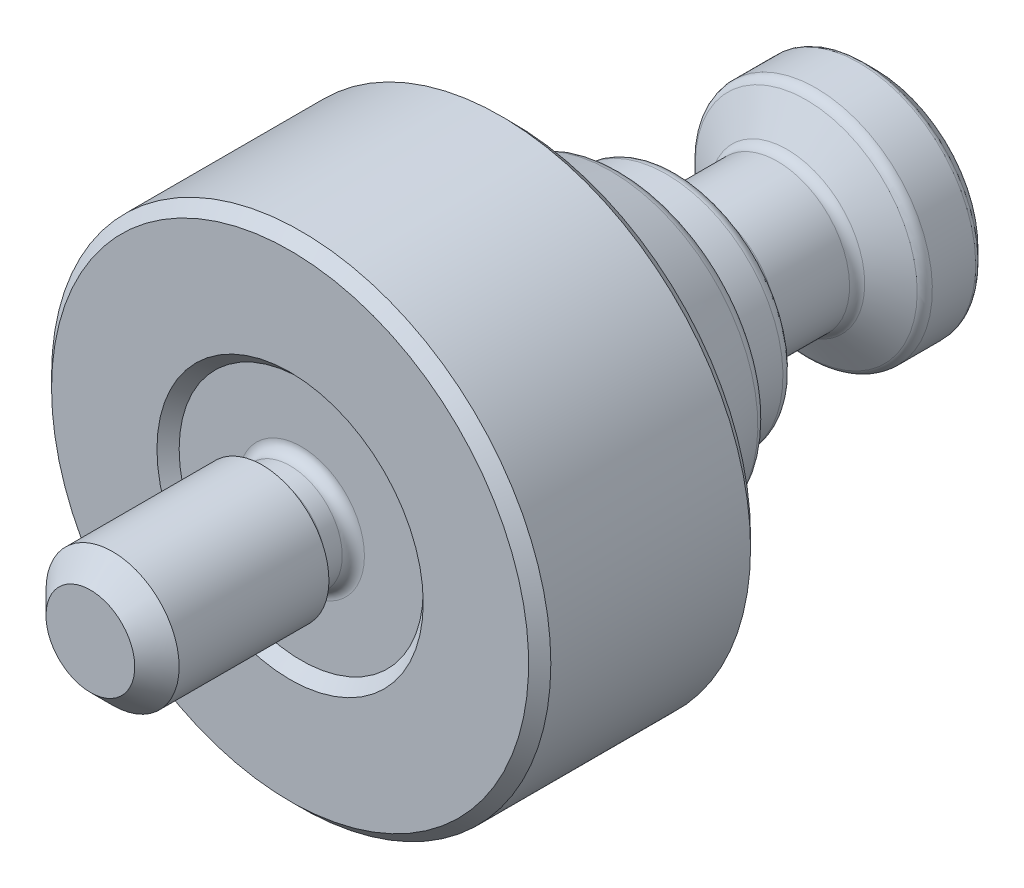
ISO-10303-21;
HEADER;
FILE_DESCRIPTION(('STEP AP214'),'2;1');
FILE_NAME('part.step','',(''),(''),'','','');
FILE_SCHEMA(('AUTOMOTIVE_DESIGN { 1 0 10303 214 1 1 1 1 }'));
ENDSEC;
DATA;
#1=APPLICATION_CONTEXT('core data for automotive mechanical design processes');
#2=APPLICATION_PROTOCOL_DEFINITION('international standard','automotive_design',2000,#1);
#3=PRODUCT_CONTEXT('',#1,'mechanical');
#4=PRODUCT('Part','Part','',(#3));
#5=PRODUCT_RELATED_PRODUCT_CATEGORY('part','',(#4));
#6=PRODUCT_DEFINITION_FORMATION('','',#4);
#7=PRODUCT_DEFINITION_CONTEXT('part definition',#1,'design');
#8=PRODUCT_DEFINITION('design','',#6,#7);
#9=PRODUCT_DEFINITION_SHAPE('','',#8);
#10=(LENGTH_UNIT() NAMED_UNIT(*) SI_UNIT(.MILLI.,.METRE.));
#11=(NAMED_UNIT(*) PLANE_ANGLE_UNIT() SI_UNIT($,.RADIAN.));
#12=(NAMED_UNIT(*) SI_UNIT($,.STERADIAN.) SOLID_ANGLE_UNIT());
#13=UNCERTAINTY_MEASURE_WITH_UNIT(LENGTH_MEASURE(1.E-05),#10,'distance_accuracy_value','');
#14=(GEOMETRIC_REPRESENTATION_CONTEXT(3) GLOBAL_UNCERTAINTY_ASSIGNED_CONTEXT((#13)) GLOBAL_UNIT_ASSIGNED_CONTEXT((#10,
#11,#12)) REPRESENTATION_CONTEXT('',''));
#15=CARTESIAN_POINT('',(0.,0.,0.));
#16=DIRECTION('',(0.,0.,1.));
#17=DIRECTION('',(1.,0.,0.));
#18=AXIS2_PLACEMENT_3D('',#15,#16,#17);
#19=CARTESIAN_POINT('',(0.,0.,19.));
#20=DIRECTION('',(0.,0.,-1.));
#21=DIRECTION('',(1.,0.,0.));
#22=AXIS2_PLACEMENT_3D('',#19,#20,#21);
#23=PLANE('',#22);
#24=CARTESIAN_POINT('',(0.,0.,19.));
#25=DIRECTION('',(0.,0.,1.));
#26=DIRECTION('',(1.,0.,0.));
#27=AXIS2_PLACEMENT_3D('',#24,#25,#26);
#28=CIRCLE('',#27,5.7);
#29=CARTESIAN_POINT('',(5.7,0.,19.));
#30=VERTEX_POINT('',#29);
#31=EDGE_CURVE('E23',#30,#30,#28,.T.);
#32=ORIENTED_EDGE('',*,*,#31,.F.);
#33=EDGE_LOOP('',(#32));
#34=FACE_BOUND('',#33,.T.);
#35=CARTESIAN_POINT('',(0.,0.,19.));
#36=DIRECTION('',(0.,0.,1.));
#37=DIRECTION('',(-1.,0.,0.));
#38=AXIS2_PLACEMENT_3D('',#35,#36,#37);
#39=CIRCLE('',#38,11.);
#40=CARTESIAN_POINT('',(-11.,0.,19.));
#41=VERTEX_POINT('',#40);
#42=EDGE_CURVE('E185',#41,#41,#39,.T.);
#43=ORIENTED_EDGE('',*,*,#42,.T.);
#44=EDGE_LOOP('',(#43));
#45=FACE_BOUND('',#44,.T.);
#46=ADVANCED_FACE('F14',(#34,#45),#23,.F.);
#47=CARTESIAN_POINT('',(0.,0.,38.));
#48=DIRECTION('',(0.,0.,1.));
#49=DIRECTION('',(0.,-1.,0.));
#50=AXIS2_PLACEMENT_3D('',#47,#48,#49);
#51=PLANE('',#50);
#52=CARTESIAN_POINT('',(0.,0.,38.));
#53=DIRECTION('',(0.,0.,1.));
#54=DIRECTION('',(0.,-1.,0.));
#55=AXIS2_PLACEMENT_3D('',#52,#53,#54);
#56=CIRCLE('',#55,4.);
#57=CARTESIAN_POINT('',(0.,-4.,38.));
#58=VERTEX_POINT('',#57);
#59=EDGE_CURVE('E125',#58,#58,#56,.T.);
#60=ORIENTED_EDGE('',*,*,#59,.T.);
#61=EDGE_LOOP('',(#60));
#62=FACE_BOUND('',#61,.T.);
#63=ADVANCED_FACE('F296',(#62),#51,.T.);
#64=CARTESIAN_POINT('',(0.,0.,36.));
#65=DIRECTION('',(0.,0.,-1.));
#66=DIRECTION('',(0.,1.,0.));
#67=AXIS2_PLACEMENT_3D('',#64,#65,#66);
#68=CONICAL_SURFACE('',#67,6.,0.78539816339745);
#69=ORIENTED_EDGE('',*,*,#59,.F.);
#70=EDGE_LOOP('',(#69));
#71=FACE_BOUND('',#70,.T.);
#72=CARTESIAN_POINT('',(0.,0.,36.));
#73=DIRECTION('',(0.,0.,1.));
#74=DIRECTION('',(0.,-1.,0.));
#75=AXIS2_PLACEMENT_3D('',#72,#73,#74);
#76=CIRCLE('',#75,6.);
#77=CARTESIAN_POINT('',(0.,-6.,36.));
#78=VERTEX_POINT('',#77);
#79=EDGE_CURVE('E122',#78,#78,#76,.F.);
#80=ORIENTED_EDGE('',*,*,#79,.F.);
#81=EDGE_LOOP('',(#80));
#82=FACE_BOUND('',#81,.T.);
#83=ADVANCED_FACE('F289',(#71,#82),#68,.T.);
#84=CARTESIAN_POINT('',(0.,0.,0.));
#85=DIRECTION('',(0.,0.,-1.));
#86=DIRECTION('',(0.,1.,0.));
#87=AXIS2_PLACEMENT_3D('',#84,#85,#86);
#88=CYLINDRICAL_SURFACE('',#87,6.);
#89=CARTESIAN_POINT('',(0.,0.,22.5));
#90=DIRECTION('',(0.,0.,-1.));
#91=DIRECTION('',(0.,1.,0.));
#92=AXIS2_PLACEMENT_3D('',#89,#90,#91);
#93=CIRCLE('',#92,6.);
#94=CARTESIAN_POINT('',(0.,6.,22.5));
#95=VERTEX_POINT('',#94);
#96=EDGE_CURVE('E193',#95,#95,#93,.T.);
#97=ORIENTED_EDGE('',*,*,#96,.F.);
#98=EDGE_LOOP('',(#97));
#99=FACE_BOUND('',#98,.T.);
#100=ORIENTED_EDGE('',*,*,#79,.T.);
#101=EDGE_LOOP('',(#100));
#102=FACE_BOUND('',#101,.T.);
#103=ADVANCED_FACE('F280',(#99,#102),#88,.T.);
#104=CARTESIAN_POINT('',(6.,0.,22.5));
#105=DIRECTION('',(0.,0.,1.));
#106=DIRECTION('',(0.,-1.,0.));
#107=AXIS2_PLACEMENT_3D('',#104,#105,#106);
#108=PLANE('',#107);
#109=CARTESIAN_POINT('',(0.,0.,22.5));
#110=DIRECTION('',(0.,0.,1.));
#111=DIRECTION('',(0.,-1.,0.));
#112=AXIS2_PLACEMENT_3D('',#109,#110,#111);
#113=CIRCLE('',#112,5.7);
#114=CARTESIAN_POINT('',(0.,-5.7,22.5));
#115=VERTEX_POINT('',#114);
#116=EDGE_CURVE('E18',#115,#115,#113,.T.);
#117=ORIENTED_EDGE('',*,*,#116,.T.);
#118=EDGE_LOOP('',(#117));
#119=FACE_BOUND('',#118,.T.);
#120=ORIENTED_EDGE('',*,*,#96,.T.);
#121=EDGE_LOOP('',(#120));
#122=FACE_BOUND('',#121,.T.);
#123=ADVANCED_FACE('F278',(#119,#122),#108,.F.);
#124=CARTESIAN_POINT('',(0.,0.,21.5));
#125=DIRECTION('',(0.,0.,1.));
#126=DIRECTION('',(0.,-1.,0.));
#127=AXIS2_PLACEMENT_3D('',#124,#125,#126);
#128=TOROIDAL_SURFACE('',#127,5.7,1.);
#129=ORIENTED_EDGE('',*,*,#116,.F.);
#130=EDGE_LOOP('',(#129));
#131=FACE_BOUND('',#130,.T.);
#132=CARTESIAN_POINT('',(0.,0.,21.5));
#133=DIRECTION('',(0.,0.,1.));
#134=DIRECTION('',(0.,-1.,0.));
#135=AXIS2_PLACEMENT_3D('',#132,#133,#134);
#136=CIRCLE('',#135,4.7);
#137=CARTESIAN_POINT('',(0.,-4.7,21.5));
#138=VERTEX_POINT('',#137);
#139=EDGE_CURVE('E161',#138,#138,#136,.F.);
#140=ORIENTED_EDGE('',*,*,#139,.F.);
#141=EDGE_LOOP('',(#140));
#142=FACE_BOUND('',#141,.T.);
#143=ADVANCED_FACE('F16',(#131,#142),#128,.F.);
#144=CARTESIAN_POINT('',(0.,0.,0.));
#145=DIRECTION('',(0.,0.,-1.));
#146=DIRECTION('',(0.,1.,0.));
#147=AXIS2_PLACEMENT_3D('',#144,#145,#146);
#148=CYLINDRICAL_SURFACE('',#147,4.7);
#149=CARTESIAN_POINT('',(0.,0.,20.));
#150=DIRECTION('',(0.,0.,1.));
#151=DIRECTION('',(0.,-1.,0.));
#152=AXIS2_PLACEMENT_3D('',#149,#150,#151);
#153=CIRCLE('',#152,4.7);
#154=CARTESIAN_POINT('',(0.,-4.7,20.));
#155=VERTEX_POINT('',#154);
#156=EDGE_CURVE('E163',#155,#155,#153,.T.);
#157=ORIENTED_EDGE('',*,*,#156,.T.);
#158=EDGE_LOOP('',(#157));
#159=FACE_BOUND('',#158,.T.);
#160=ORIENTED_EDGE('',*,*,#139,.T.);
#161=EDGE_LOOP('',(#160));
#162=FACE_BOUND('',#161,.T.);
#163=ADVANCED_FACE('F282',(#159,#162),#148,.T.);
#164=CARTESIAN_POINT('',(0.,0.,20.));
#165=DIRECTION('',(0.,0.,1.));
#166=DIRECTION('',(0.,-1.,0.));
#167=AXIS2_PLACEMENT_3D('',#164,#165,#166);
#168=TOROIDAL_SURFACE('',#167,5.7,1.);
#169=ORIENTED_EDGE('',*,*,#156,.F.);
#170=EDGE_LOOP('',(#169));
#171=FACE_BOUND('',#170,.T.);
#172=ORIENTED_EDGE('',*,*,#31,.T.);
#173=EDGE_LOOP('',(#172));
#174=FACE_BOUND('',#173,.T.);
#175=ADVANCED_FACE('F288',(#171,#174),#168,.F.);
#176=CARTESIAN_POINT('',(0.,0.,19.));
#177=DIRECTION('',(0.,0.,-1.));
#178=DIRECTION('',(1.,0.,0.));
#179=AXIS2_PLACEMENT_3D('',#176,#177,#178);
#180=CONICAL_SURFACE('',#179,22.5,0.78539816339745);
#181=CARTESIAN_POINT('',(0.,0.,20.));
#182=DIRECTION('',(0.,0.,1.));
#183=DIRECTION('',(-1.,0.,0.));
#184=AXIS2_PLACEMENT_3D('',#181,#182,#183);
#185=CIRCLE('',#184,21.5);
#186=CARTESIAN_POINT('',(-21.5,0.,20.));
#187=VERTEX_POINT('',#186);
#188=EDGE_CURVE('E177',#187,#187,#185,.T.);
#189=ORIENTED_EDGE('',*,*,#188,.F.);
#190=EDGE_LOOP('',(#189));
#191=FACE_BOUND('',#190,.T.);
#192=CARTESIAN_POINT('',(0.,0.,19.));
#193=DIRECTION('',(0.,0.,1.));
#194=DIRECTION('',(-1.,0.,0.));
#195=AXIS2_PLACEMENT_3D('',#192,#193,#194);
#196=CIRCLE('',#195,22.5);
#197=CARTESIAN_POINT('',(-22.5,0.,19.));
#198=VERTEX_POINT('',#197);
#199=EDGE_CURVE('E172',#198,#198,#196,.F.);
#200=ORIENTED_EDGE('',*,*,#199,.F.);
#201=EDGE_LOOP('',(#200));
#202=FACE_BOUND('',#201,.T.);
#203=ADVANCED_FACE('F300',(#191,#202),#180,.T.);
#204=CARTESIAN_POINT('',(11.0000000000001,0.,20.));
#205=DIRECTION('',(0.,0.,1.));
#206=DIRECTION('',(-1.,0.,0.));
#207=AXIS2_PLACEMENT_3D('',#204,#205,#206);
#208=PLANE('',#207);
#209=CARTESIAN_POINT('',(0.,0.,20.));
#210=DIRECTION('',(0.,0.,1.));
#211=DIRECTION('',(-1.,0.,0.));
#212=AXIS2_PLACEMENT_3D('',#209,#210,#211);
#213=CIRCLE('',#212,12.);
#214=CARTESIAN_POINT('',(-12.,0.,20.));
#215=VERTEX_POINT('',#214);
#216=EDGE_CURVE('E188',#215,#215,#213,.F.);
#217=ORIENTED_EDGE('',*,*,#216,.T.);
#218=EDGE_LOOP('',(#217));
#219=FACE_BOUND('',#218,.T.);
#220=ORIENTED_EDGE('',*,*,#188,.T.);
#221=EDGE_LOOP('',(#220));
#222=FACE_BOUND('',#221,.T.);
#223=ADVANCED_FACE('F381',(#219,#222),#208,.T.);
#224=CARTESIAN_POINT('',(0.,0.,20.));
#225=DIRECTION('',(0.,0.,1.));
#226=DIRECTION('',(-1.,0.,0.));
#227=AXIS2_PLACEMENT_3D('',#224,#225,#226);
#228=CONICAL_SURFACE('',#227,12.,0.785398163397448);
#229=ORIENTED_EDGE('',*,*,#42,.F.);
#230=EDGE_LOOP('',(#229));
#231=FACE_BOUND('',#230,.T.);
#232=ORIENTED_EDGE('',*,*,#216,.F.);
#233=EDGE_LOOP('',(#232));
#234=FACE_BOUND('',#233,.T.);
#235=ADVANCED_FACE('F385',(#231,#234),#228,.F.);
#236=CARTESIAN_POINT('',(0.,0.,0.));
#237=DIRECTION('',(0.,0.,-1.));
#238=DIRECTION('',(1.,0.,0.));
#239=AXIS2_PLACEMENT_3D('',#236,#237,#238);
#240=CYLINDRICAL_SURFACE('',#239,22.5);
#241=ORIENTED_EDGE('',*,*,#199,.T.);
#242=EDGE_LOOP('',(#241));
#243=FACE_BOUND('',#242,.T.);
#244=CARTESIAN_POINT('',(0.,0.,0.999999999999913));
#245=DIRECTION('',(0.,0.,-1.));
#246=DIRECTION('',(1.,0.,0.));
#247=AXIS2_PLACEMENT_3D('',#244,#245,#246);
#248=CIRCLE('',#247,22.5);
#249=CARTESIAN_POINT('',(22.5,0.,0.999999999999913));
#250=VERTEX_POINT('',#249);
#251=EDGE_CURVE('E168',#250,#250,#248,.F.);
#252=ORIENTED_EDGE('',*,*,#251,.T.);
#253=EDGE_LOOP('',(#252));
#254=FACE_BOUND('',#253,.T.);
#255=ADVANCED_FACE('F375',(#243,#254),#240,.T.);
#256=CARTESIAN_POINT('',(0.,0.,-1.19379064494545E-13));
#257=DIRECTION('',(0.,0.,1.));
#258=DIRECTION('',(-1.,0.,0.));
#259=AXIS2_PLACEMENT_3D('',#256,#257,#258);
#260=CONICAL_SURFACE('',#259,21.5,0.785398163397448);
#261=ORIENTED_EDGE('',*,*,#251,.F.);
#262=EDGE_LOOP('',(#261));
#263=FACE_BOUND('',#262,.T.);
#264=CARTESIAN_POINT('',(0.,0.,-1.19379064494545E-13));
#265=DIRECTION('',(0.,0.,-1.));
#266=DIRECTION('',(1.,0.,0.));
#267=AXIS2_PLACEMENT_3D('',#264,#265,#266);
#268=CIRCLE('',#267,21.5);
#269=CARTESIAN_POINT('',(21.5,0.,-1.19379064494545E-13));
#270=VERTEX_POINT('',#269);
#271=EDGE_CURVE('E182',#270,#270,#268,.T.);
#272=ORIENTED_EDGE('',*,*,#271,.F.);
#273=EDGE_LOOP('',(#272));
#274=FACE_BOUND('',#273,.T.);
#275=ADVANCED_FACE('F368',(#263,#274),#260,.T.);
#276=CARTESIAN_POINT('',(22.5,0.,-1.19379064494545E-13));
#277=DIRECTION('',(0.,0.,-1.));
#278=DIRECTION('',(1.,0.,0.));
#279=AXIS2_PLACEMENT_3D('',#276,#277,#278);
#280=PLANE('',#279);
#281=ORIENTED_EDGE('',*,*,#271,.T.);
#282=EDGE_LOOP('',(#281));
#283=FACE_BOUND('',#282,.T.);
#284=CARTESIAN_POINT('',(0.,0.,-1.19370659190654E-13));
#285=DIRECTION('',(0.,0.,-1.));
#286=DIRECTION('',(-1.,0.,0.));
#287=AXIS2_PLACEMENT_3D('',#284,#285,#286);
#288=CIRCLE('',#287,15.3);
#289=CARTESIAN_POINT('',(-15.3,0.,-1.19370659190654E-13));
#290=VERTEX_POINT('',#289);
#291=EDGE_CURVE('E9',#290,#290,#288,.T.);
#292=ORIENTED_EDGE('',*,*,#291,.F.);
#293=EDGE_LOOP('',(#292));
#294=FACE_BOUND('',#293,.T.);
#295=ADVANCED_FACE('F358',(#283,#294),#280,.T.);
#296=CARTESIAN_POINT('',(3.46410161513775,0.,-28.5));
#297=DIRECTION('',(0.,0.,-1.));
#298=DIRECTION('',(0.,1.,0.));
#299=AXIS2_PLACEMENT_3D('',#296,#297,#298);
#300=PLANE('',#299);
#301=DIRECTION('',(-0.5,0.866025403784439,0.));
#302=VECTOR('',#301,1.);
#303=CARTESIAN_POINT('',(-1.73205080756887,-3.,-28.5));
#304=LINE('',#303,#302);
#305=CARTESIAN_POINT('',(-1.73205080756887,-3.,-28.5));
#306=VERTEX_POINT('',#305);
#307=CARTESIAN_POINT('',(-3.46410161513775,0.,-28.5));
#308=VERTEX_POINT('',#307);
#309=EDGE_CURVE('E698',#306,#308,#304,.T.);
#310=ORIENTED_EDGE('',*,*,#309,.T.);
#311=DIRECTION('',(0.5,0.866025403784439,0.));
#312=VECTOR('',#311,1.);
#313=CARTESIAN_POINT('',(-3.46410161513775,0.,-28.5));
#314=LINE('',#313,#312);
#315=CARTESIAN_POINT('',(-1.73205080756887,3.,-28.5));
#316=VERTEX_POINT('',#315);
#317=EDGE_CURVE('E699',#308,#316,#314,.T.);
#318=ORIENTED_EDGE('',*,*,#317,.T.);
#319=DIRECTION('',(1.,0.,0.));
#320=VECTOR('',#319,1.);
#321=CARTESIAN_POINT('',(-1.73205080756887,3.,-28.5));
#322=LINE('',#321,#320);
#323=CARTESIAN_POINT('',(1.73205080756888,3.,-28.5));
#324=VERTEX_POINT('',#323);
#325=EDGE_CURVE('E39',#316,#324,#322,.T.);
#326=ORIENTED_EDGE('',*,*,#325,.T.);
#327=DIRECTION('',(0.5,-0.866025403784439,0.));
#328=VECTOR('',#327,1.);
#329=CARTESIAN_POINT('',(1.73205080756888,3.,-28.5));
#330=LINE('',#329,#328);
#331=CARTESIAN_POINT('',(3.46410161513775,0.,-28.5));
#332=VERTEX_POINT('',#331);
#333=EDGE_CURVE('E87',#324,#332,#330,.T.);
#334=ORIENTED_EDGE('',*,*,#333,.T.);
#335=DIRECTION('',(-0.5,-0.866025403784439,0.));
#336=VECTOR('',#335,1.);
#337=CARTESIAN_POINT('',(3.46410161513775,0.,-28.5));
#338=LINE('',#337,#336);
#339=CARTESIAN_POINT('',(1.73205080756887,-3.,-28.5));
#340=VERTEX_POINT('',#339);
#341=EDGE_CURVE('E702',#332,#340,#338,.T.);
#342=ORIENTED_EDGE('',*,*,#341,.T.);
#343=DIRECTION('',(-1.,0.,0.));
#344=VECTOR('',#343,1.);
#345=CARTESIAN_POINT('',(1.73205080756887,-3.,-28.5));
#346=LINE('',#345,#344);
#347=EDGE_CURVE('E700',#340,#306,#346,.T.);
#348=ORIENTED_EDGE('',*,*,#347,.T.);
#349=EDGE_LOOP('',(#310,#318,#326,#334,#342,#348));
#350=FACE_BOUND('',#349,.T.);
#351=ADVANCED_FACE('F261',(#350),#300,.T.);
#352=CARTESIAN_POINT('',(1.73205080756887,-3.,-28.5));
#353=DIRECTION('',(0.,-1.,0.));
#354=DIRECTION('',(1.,0.,0.));
#355=AXIS2_PLACEMENT_3D('',#352,#353,#354);
#356=PLANE('',#355);
#357=CARTESIAN_POINT('',(-4.57816394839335,-3.,-33.9950833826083));
#358=CARTESIAN_POINT('',(-4.44770534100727,-3.,-33.9321019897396));
#359=CARTESIAN_POINT('',(-4.3169390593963,-3.,-33.8697465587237));
#360=CARTESIAN_POINT('',(-4.05462715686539,-3.,-33.7466413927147));
#361=CARTESIAN_POINT('',(-3.92308140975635,-3.,-33.6858919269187));
#362=CARTESIAN_POINT('',(-3.65833272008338,-3.,-33.5660308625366));
#363=CARTESIAN_POINT('',(-3.52512459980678,-3.,-33.5069306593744));
#364=CARTESIAN_POINT('',(-3.25762204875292,-3.,-33.3912515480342));
#365=CARTESIAN_POINT('',(-3.12332767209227,-3.,-33.3346725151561));
#366=CARTESIAN_POINT('',(-2.849471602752,-3.,-33.2230876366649));
#367=CARTESIAN_POINT('',(-2.70987100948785,-3.,-33.168176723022));
#368=CARTESIAN_POINT('',(-2.429009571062,-3.,-33.0626937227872));
#369=CARTESIAN_POINT('',(-2.28774853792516,-3.,-33.0121221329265));
#370=CARTESIAN_POINT('',(-2.00363062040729,-3.,-32.9166996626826));
#371=CARTESIAN_POINT('',(-1.86077789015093,-3.,-32.871836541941));
#372=CARTESIAN_POINT('',(-1.5730258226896,-3.,-32.7893189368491));
#373=CARTESIAN_POINT('',(-1.4281271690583,-3.,-32.7516621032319));
#374=CARTESIAN_POINT('',(-1.13695389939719,-3.,-32.6855990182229));
#375=CARTESIAN_POINT('',(-0.990689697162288,-3.,-32.657147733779));
#376=CARTESIAN_POINT('',(-0.696423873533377,-3.,-32.6111671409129));
#377=CARTESIAN_POINT('',(-0.548422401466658,-3.,-32.5936369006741));
#378=CARTESIAN_POINT('',(-0.253322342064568,-3.,-32.5711271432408));
#379=CARTESIAN_POINT('',(-0.106235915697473,-3.,-32.5659920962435));
#380=CARTESIAN_POINT('',(0.18784914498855,-3.,-32.568302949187));
#381=CARTESIAN_POINT('',(0.334847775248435,-3.,-32.5757493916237));
#382=CARTESIAN_POINT('',(0.586621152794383,-3.,-32.5987632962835));
#383=CARTESIAN_POINT('',(0.691671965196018,-3.,-32.6114663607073));
#384=CARTESIAN_POINT('',(0.900950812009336,-3.,-32.6424661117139));
#385=CARTESIAN_POINT('',(1.00517872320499,-3.,-32.6607636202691));
#386=CARTESIAN_POINT('',(1.316515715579,-3.,-32.7230802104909));
#387=CARTESIAN_POINT('',(1.52215497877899,-3.,-32.7745106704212));
#388=CARTESIAN_POINT('',(1.82965945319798,-3.,-32.8630327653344));
#389=CARTESIAN_POINT('',(1.93313257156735,-3.,-32.8948509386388));
#390=CARTESIAN_POINT('',(2.13907223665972,-3.,-32.9616217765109));
#391=CARTESIAN_POINT('',(2.24153877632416,-3.,-32.9965744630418));
#392=CARTESIAN_POINT('',(2.44550231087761,-3.,-33.0690674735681));
#393=CARTESIAN_POINT('',(2.54699964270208,-3.,-33.1066068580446));
#394=CARTESIAN_POINT('',(2.74916366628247,-3.,-33.1838485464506));
#395=CARTESIAN_POINT('',(2.84983037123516,-3.,-33.2235508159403));
#396=CARTESIAN_POINT('',(3.1028586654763,-3.,-33.325976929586));
#397=CARTESIAN_POINT('',(3.25473921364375,-3.,-33.3898874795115));
#398=CARTESIAN_POINT('',(3.5571231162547,-3.,-33.5208972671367));
#399=CARTESIAN_POINT('',(3.70762636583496,-3.,-33.587996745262));
#400=CARTESIAN_POINT('',(4.00754037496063,-3.,-33.7246828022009));
#401=CARTESIAN_POINT('',(4.15695085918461,-3.,-33.7942699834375));
#402=CARTESIAN_POINT('',(4.4548506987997,-3.,-33.9353919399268));
#403=CARTESIAN_POINT('',(4.60334003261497,-3.,-34.0069267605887));
#404=CARTESIAN_POINT('',(5.0480378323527,-3.,-34.224009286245));
#405=CARTESIAN_POINT('',(5.34311674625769,-3.,-34.3718687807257));
#406=CARTESIAN_POINT('',(5.93116502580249,-3.,-34.6715928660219));
#407=CARTESIAN_POINT('',(6.22413469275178,-3.,-34.823456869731));
#408=CARTESIAN_POINT('',(6.78142028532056,-3.,-35.1157233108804));
#409=CARTESIAN_POINT('',(7.04586647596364,-3.,-35.2558777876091));
#410=CARTESIAN_POINT('',(7.57386151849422,-3.,-35.5378914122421));
#411=CARTESIAN_POINT('',(7.83741033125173,-3.,-35.67975063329));
#412=CARTESIAN_POINT('',(8.3631137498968,-3.,-35.9643722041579));
#413=CARTESIAN_POINT('',(8.62527019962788,-3.,-36.1071311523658));
#414=CARTESIAN_POINT('',(9.14901852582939,-3.,-36.3936442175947));
#415=CARTESIAN_POINT('',(9.41061043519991,-3.,-36.5373982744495));
#416=CARTESIAN_POINT('',(9.67199904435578,-3.,-36.6815185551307));
#417=B_SPLINE_CURVE_WITH_KNOTS('',3,(#357,#358,#359,#360,#361,#362,#363,#364,#365,#366,#367,
#368,#369,#370,#371,#372,#373,#374,#375,#376,#377,#378,#379,#380,#381,#382,#383,#384,#385,#386,
#387,#388,#389,#390,#391,#392,#393,#394,#395,#396,#397,#398,#399,#400,#401,#402,#403,#404,#405,
#406,#407,#408,#409,#410,#411,#412,#413,#414,#415,#416),.UNSPECIFIED.,.F.,.F.,(4,2,2,2,2,2,2,2,
2,2,2,2,2,2,2,2,2,2,2,2,2,2,2,2,2,2,2,2,2,4),(0.,0.434603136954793,0.869278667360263,
1.30644784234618,1.74359537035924,2.19357500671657,2.64360608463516,3.09265531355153,
3.54155790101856,3.98823005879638,4.43486409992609,4.87586414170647,5.31688319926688,
5.63417619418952,5.95151583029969,6.58656462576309,6.91130347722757,7.23604460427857,
7.56066839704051,7.88528702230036,8.37957333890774,8.87389698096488,9.36834115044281,
9.86279685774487,10.8528958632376,11.842850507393,12.7407149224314,13.6386179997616,
14.5341350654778,15.4295984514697),.UNSPECIFIED.);
#418=CARTESIAN_POINT('',(-1.73205080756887,-3.,-32.8349364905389));
#419=VERTEX_POINT('',#418);
#420=CARTESIAN_POINT('',(1.73205080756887,-3.,-32.8349364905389));
#421=VERTEX_POINT('',#420);
#422=EDGE_CURVE('E246',#419,#421,#417,.T.);
#423=ORIENTED_EDGE('',*,*,#422,.F.);
#424=DIRECTION('',(0.,0.,-1.));
#425=VECTOR('',#424,1.);
#426=CARTESIAN_POINT('',(-1.73205080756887,-3.,-28.5));
#427=LINE('',#426,#425);
#428=EDGE_CURVE('E100',#306,#419,#427,.T.);
#429=ORIENTED_EDGE('',*,*,#428,.F.);
#430=ORIENTED_EDGE('',*,*,#347,.F.);
#431=DIRECTION('',(0.,0.,-1.));
#432=VECTOR('',#431,1.);
#433=CARTESIAN_POINT('',(1.73205080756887,-3.,-28.5));
#434=LINE('',#433,#432);
#435=EDGE_CURVE('E103',#340,#421,#434,.T.);
#436=ORIENTED_EDGE('',*,*,#435,.T.);
#437=EDGE_LOOP('',(#423,#429,#430,#436));
#438=FACE_BOUND('',#437,.T.);
#439=ADVANCED_FACE('F257',(#438),#356,.F.);
#440=CARTESIAN_POINT('',(-1.73205080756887,-3.,-28.5));
#441=DIRECTION('',(-0.866025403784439,-0.5,0.));
#442=DIRECTION('',(0.5,-0.866025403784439,0.));
#443=AXIS2_PLACEMENT_3D('',#440,#441,#442);
#444=PLANE('',#443);
#445=CARTESIAN_POINT('',(-3.4642170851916,0.000199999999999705,-32.8350031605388));
#446=CARTESIAN_POINT('',(-3.38810199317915,-0.13163520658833,-32.7910410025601));
#447=CARTESIAN_POINT('',(-3.31132988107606,-0.264608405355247,-32.7510588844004));
#448=CARTESIAN_POINT('',(-3.15645624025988,-0.532857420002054,-32.6812693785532));
#449=CARTESIAN_POINT('',(-3.078351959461,-0.66813800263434,-32.6514866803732));
#450=CARTESIAN_POINT('',(-2.92311136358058,-0.937022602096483,-32.605125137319));
#451=CARTESIAN_POINT('',(-2.84599893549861,-1.07058524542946,-32.5882377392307));
#452=CARTESIAN_POINT('',(-2.69141120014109,-1.33833905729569,-32.5680769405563));
#453=CARTESIAN_POINT('',(-2.61393645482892,-1.47252925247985,-32.5647868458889));
#454=CARTESIAN_POINT('',(-2.46916798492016,-1.72327559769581,-32.5716278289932));
#455=CARTESIAN_POINT('',(-2.40185259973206,-1.83986926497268,-32.5800792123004));
#456=CARTESIAN_POINT('',(-2.26766039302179,-2.07229698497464,-32.6068662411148));
#457=CARTESIAN_POINT('',(-2.20078403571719,-2.18813023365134,-32.6252110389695));
#458=CARTESIAN_POINT('',(-2.06631510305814,-2.42103725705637,-32.6710720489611));
#459=CARTESIAN_POINT('',(-1.9987395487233,-2.53808155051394,-32.6987826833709));
#460=CARTESIAN_POINT('',(-1.86459637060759,-2.77042435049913,-32.7616750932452));
#461=CARTESIAN_POINT('',(-1.79802702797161,-2.88572583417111,-32.7968420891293));
#462=CARTESIAN_POINT('',(-1.73193533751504,-3.0002,-32.8350031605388));
#463=B_SPLINE_CURVE_WITH_KNOTS('',3,(#445,#446,#447,#448,#449,#450,#451,#452,#453,#454,#455,
#456,#457,#458,#459,#460,#461,#462),.UNSPECIFIED.,.F.,.F.,(4,2,2,2,2,2,2,2,4),(0.,
0.475539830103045,0.952222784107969,1.41710776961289,1.88142182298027,2.28572436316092,
2.6904015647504,3.10405572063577,3.51689749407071),.UNSPECIFIED.);
#464=CARTESIAN_POINT('',(-3.46410161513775,0.,-32.8349364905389));
#465=VERTEX_POINT('',#464);
#466=EDGE_CURVE('E239',#465,#419,#463,.T.);
#467=ORIENTED_EDGE('',*,*,#466,.F.);
#468=DIRECTION('',(0.,0.,-1.));
#469=VECTOR('',#468,1.);
#470=CARTESIAN_POINT('',(-3.46410161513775,0.,-28.5));
#471=LINE('',#470,#469);
#472=EDGE_CURVE('E93',#308,#465,#471,.T.);
#473=ORIENTED_EDGE('',*,*,#472,.F.);
#474=ORIENTED_EDGE('',*,*,#309,.F.);
#475=ORIENTED_EDGE('',*,*,#428,.T.);
#476=EDGE_LOOP('',(#467,#473,#474,#475));
#477=FACE_BOUND('',#476,.T.);
#478=ADVANCED_FACE('F260',(#477),#444,.F.);
#479=CARTESIAN_POINT('',(-3.46410161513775,0.,-28.5));
#480=DIRECTION('',(-0.866025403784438,0.5,0.));
#481=DIRECTION('',(-0.5,-0.866025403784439,0.));
#482=AXIS2_PLACEMENT_3D('',#479,#480,#481);
#483=PLANE('',#482);
#484=CARTESIAN_POINT('',(-1.73193533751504,3.0002,-32.8350031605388));
#485=CARTESIAN_POINT('',(-1.80805042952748,2.86836479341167,-32.7910410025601));
#486=CARTESIAN_POINT('',(-1.88482254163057,2.73539159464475,-32.7510588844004));
#487=CARTESIAN_POINT('',(-2.03969618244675,2.46714257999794,-32.6812693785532));
#488=CARTESIAN_POINT('',(-2.11780046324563,2.33186199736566,-32.6514866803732));
#489=CARTESIAN_POINT('',(-2.27304105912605,2.06297739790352,-32.605125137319));
#490=CARTESIAN_POINT('',(-2.35015348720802,1.92941475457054,-32.5882377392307));
#491=CARTESIAN_POINT('',(-2.50474122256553,1.66166094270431,-32.5680769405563));
#492=CARTESIAN_POINT('',(-2.58221596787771,1.52747074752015,-32.5647868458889));
#493=CARTESIAN_POINT('',(-2.72698443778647,1.27672440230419,-32.5716278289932));
#494=CARTESIAN_POINT('',(-2.79429982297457,1.16013073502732,-32.5800792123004));
#495=CARTESIAN_POINT('',(-2.92849202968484,0.927703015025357,-32.6068662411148));
#496=CARTESIAN_POINT('',(-2.99536838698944,0.811869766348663,-32.6252110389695));
#497=CARTESIAN_POINT('',(-3.12983731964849,0.578962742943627,-32.6710720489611));
#498=CARTESIAN_POINT('',(-3.19741287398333,0.461918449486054,-32.6987826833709));
#499=CARTESIAN_POINT('',(-3.33155605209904,0.229575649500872,-32.7616750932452));
#500=CARTESIAN_POINT('',(-3.39812539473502,0.114274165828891,-32.7968420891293));
#501=CARTESIAN_POINT('',(-3.4642170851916,-0.000200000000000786,-32.8350031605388));
#502=B_SPLINE_CURVE_WITH_KNOTS('',3,(#484,#485,#486,#487,#488,#489,#490,#491,#492,#493,#494,
#495,#496,#497,#498,#499,#500,#501),.UNSPECIFIED.,.F.,.F.,(4,2,2,2,2,2,2,2,4),(0.,
0.475539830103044,0.952222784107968,1.41710776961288,1.88142182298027,2.28572436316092,
2.6904015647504,3.10405572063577,3.51689749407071),.UNSPECIFIED.);
#503=CARTESIAN_POINT('',(-1.73205080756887,3.,-32.8349364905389));
#504=VERTEX_POINT('',#503);
#505=EDGE_CURVE('E84',#504,#465,#502,.T.);
#506=ORIENTED_EDGE('',*,*,#505,.F.);
#507=DIRECTION('',(0.,0.,-1.));
#508=VECTOR('',#507,1.);
#509=CARTESIAN_POINT('',(-1.73205080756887,3.,-28.5));
#510=LINE('',#509,#508);
#511=EDGE_CURVE('E83',#316,#504,#510,.T.);
#512=ORIENTED_EDGE('',*,*,#511,.F.);
#513=ORIENTED_EDGE('',*,*,#317,.F.);
#514=ORIENTED_EDGE('',*,*,#472,.T.);
#515=EDGE_LOOP('',(#506,#512,#513,#514));
#516=FACE_BOUND('',#515,.T.);
#517=ADVANCED_FACE('F560',(#516),#483,.F.);
#518=CARTESIAN_POINT('',(-1.73205080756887,3.,-28.5));
#519=DIRECTION('',(0.,1.,0.));
#520=DIRECTION('',(-1.,0.,0.));
#521=AXIS2_PLACEMENT_3D('',#518,#519,#520);
#522=PLANE('',#521);
#523=CARTESIAN_POINT('',(-4.57816394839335,3.,-33.9950833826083));
#524=CARTESIAN_POINT('',(-4.44770534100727,3.,-33.9321019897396));
#525=CARTESIAN_POINT('',(-4.3169390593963,3.,-33.8697465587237));
#526=CARTESIAN_POINT('',(-4.05462715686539,3.,-33.7466413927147));
#527=CARTESIAN_POINT('',(-3.92308140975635,3.,-33.6858919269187));
#528=CARTESIAN_POINT('',(-3.65833272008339,3.,-33.5660308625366));
#529=CARTESIAN_POINT('',(-3.52512459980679,3.,-33.5069306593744));
#530=CARTESIAN_POINT('',(-3.25762204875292,3.,-33.3912515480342));
#531=CARTESIAN_POINT('',(-3.12332767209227,3.,-33.3346725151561));
#532=CARTESIAN_POINT('',(-2.849471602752,3.,-33.2230876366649));
#533=CARTESIAN_POINT('',(-2.70987100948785,3.,-33.168176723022));
#534=CARTESIAN_POINT('',(-2.429009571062,3.,-33.0626937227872));
#535=CARTESIAN_POINT('',(-2.28774853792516,3.,-33.0121221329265));
#536=CARTESIAN_POINT('',(-2.00363062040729,3.,-32.9166996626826));
#537=CARTESIAN_POINT('',(-1.86077789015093,3.,-32.871836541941));
#538=CARTESIAN_POINT('',(-1.5730258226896,3.,-32.7893189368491));
#539=CARTESIAN_POINT('',(-1.4281271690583,3.,-32.7516621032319));
#540=CARTESIAN_POINT('',(-1.13695389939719,3.,-32.6855990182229));
#541=CARTESIAN_POINT('',(-0.990689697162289,3.,-32.657147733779));
#542=CARTESIAN_POINT('',(-0.696423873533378,3.,-32.6111671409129));
#543=CARTESIAN_POINT('',(-0.548422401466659,3.,-32.5936369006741));
#544=CARTESIAN_POINT('',(-0.253322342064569,3.,-32.5711271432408));
#545=CARTESIAN_POINT('',(-0.106235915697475,3.,-32.5659920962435));
#546=CARTESIAN_POINT('',(0.187849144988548,3.,-32.568302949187));
#547=CARTESIAN_POINT('',(0.334847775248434,3.,-32.5757493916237));
#548=CARTESIAN_POINT('',(0.586621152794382,3.,-32.5987632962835));
#549=CARTESIAN_POINT('',(0.691671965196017,3.,-32.6114663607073));
#550=CARTESIAN_POINT('',(0.900950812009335,3.,-32.6424661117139));
#551=CARTESIAN_POINT('',(1.00517872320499,3.,-32.6607636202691));
#552=CARTESIAN_POINT('',(1.316515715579,3.,-32.7230802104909));
#553=CARTESIAN_POINT('',(1.52215497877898,3.,-32.7745106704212));
#554=CARTESIAN_POINT('',(1.82965945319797,3.,-32.8630327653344));
#555=CARTESIAN_POINT('',(1.93313257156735,3.,-32.8948509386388));
#556=CARTESIAN_POINT('',(2.13907223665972,3.,-32.9616217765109));
#557=CARTESIAN_POINT('',(2.24153877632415,3.,-32.9965744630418));
#558=CARTESIAN_POINT('',(2.4455023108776,3.,-33.0690674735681));
#559=CARTESIAN_POINT('',(2.54699964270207,3.,-33.1066068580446));
#560=CARTESIAN_POINT('',(2.74916366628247,3.,-33.1838485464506));
#561=CARTESIAN_POINT('',(2.84983037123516,3.,-33.2235508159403));
#562=CARTESIAN_POINT('',(3.10285866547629,3.,-33.325976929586));
#563=CARTESIAN_POINT('',(3.25473921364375,3.,-33.3898874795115));
#564=CARTESIAN_POINT('',(3.5571231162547,3.,-33.5208972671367));
#565=CARTESIAN_POINT('',(3.70762636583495,3.,-33.587996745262));
#566=CARTESIAN_POINT('',(4.00754037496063,3.,-33.7246828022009));
#567=CARTESIAN_POINT('',(4.1569508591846,3.,-33.7942699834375));
#568=CARTESIAN_POINT('',(4.45485069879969,3.,-33.9353919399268));
#569=CARTESIAN_POINT('',(4.60334003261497,3.,-34.0069267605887));
#570=CARTESIAN_POINT('',(5.04803783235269,3.,-34.224009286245));
#571=CARTESIAN_POINT('',(5.34311674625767,3.,-34.3718687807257));
#572=CARTESIAN_POINT('',(5.93116502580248,3.,-34.6715928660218));
#573=CARTESIAN_POINT('',(6.22413469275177,3.,-34.823456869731));
#574=CARTESIAN_POINT('',(6.78142028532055,3.,-35.1157233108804));
#575=CARTESIAN_POINT('',(7.04586647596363,3.,-35.2558777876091));
#576=CARTESIAN_POINT('',(7.57386151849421,3.,-35.5378914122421));
#577=CARTESIAN_POINT('',(7.83741033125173,3.,-35.67975063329));
#578=CARTESIAN_POINT('',(8.36311374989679,3.,-35.9643722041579));
#579=CARTESIAN_POINT('',(8.62527019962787,3.,-36.1071311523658));
#580=CARTESIAN_POINT('',(9.14901852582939,3.,-36.3936442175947));
#581=CARTESIAN_POINT('',(9.41061043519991,3.,-36.5373982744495));
#582=CARTESIAN_POINT('',(9.67199904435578,3.,-36.6815185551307));
#583=B_SPLINE_CURVE_WITH_KNOTS('',3,(#523,#524,#525,#526,#527,#528,#529,#530,#531,#532,#533,
#534,#535,#536,#537,#538,#539,#540,#541,#542,#543,#544,#545,#546,#547,#548,#549,#550,#551,#552,
#553,#554,#555,#556,#557,#558,#559,#560,#561,#562,#563,#564,#565,#566,#567,#568,#569,#570,#571,
#572,#573,#574,#575,#576,#577,#578,#579,#580,#581,#582),.UNSPECIFIED.,.F.,.F.,(4,2,2,2,2,2,2,2,
2,2,2,2,2,2,2,2,2,2,2,2,2,2,2,2,2,2,2,2,2,4),(0.,0.434603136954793,0.869278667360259,
1.30644784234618,1.74359537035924,2.19357500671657,2.64360608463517,3.09265531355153,
3.54155790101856,3.98823005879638,4.43486409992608,4.87586414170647,5.31688319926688,
5.63417619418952,5.95151583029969,6.58656462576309,6.91130347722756,7.23604460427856,
7.56066839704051,7.88528702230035,8.37957333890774,8.87389698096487,9.36834115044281,
9.86279685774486,10.8528958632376,11.842850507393,12.7407149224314,13.6386179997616,
14.5341350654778,15.4295984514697),.UNSPECIFIED.);
#584=CARTESIAN_POINT('',(1.73205080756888,3.,-32.8349364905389));
#585=VERTEX_POINT('',#584);
#586=EDGE_CURVE('E69',#585,#504,#583,.F.);
#587=ORIENTED_EDGE('',*,*,#586,.F.);
#588=DIRECTION('',(0.,0.,-1.));
#589=VECTOR('',#588,1.);
#590=CARTESIAN_POINT('',(1.73205080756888,3.,-28.5));
#591=LINE('',#590,#589);
#592=EDGE_CURVE('E80',#324,#585,#591,.T.);
#593=ORIENTED_EDGE('',*,*,#592,.F.);
#594=ORIENTED_EDGE('',*,*,#325,.F.);
#595=ORIENTED_EDGE('',*,*,#511,.T.);
#596=EDGE_LOOP('',(#587,#593,#594,#595));
#597=FACE_BOUND('',#596,.T.);
#598=ADVANCED_FACE('F79',(#597),#522,.F.);
#599=CARTESIAN_POINT('',(1.73205080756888,3.,-28.5));
#600=DIRECTION('',(0.866025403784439,0.5,0.));
#601=DIRECTION('',(-0.5,0.866025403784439,0.));
#602=AXIS2_PLACEMENT_3D('',#599,#600,#601);
#603=PLANE('',#602);
#604=CARTESIAN_POINT('',(3.4642170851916,-0.000199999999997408,-32.8350031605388));
#605=CARTESIAN_POINT('',(3.38810199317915,0.131635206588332,-32.7910410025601));
#606=CARTESIAN_POINT('',(3.31132988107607,0.26460840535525,-32.7510588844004));
#607=CARTESIAN_POINT('',(3.15645624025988,0.532857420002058,-32.6812693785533));
#608=CARTESIAN_POINT('',(3.078351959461,0.668138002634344,-32.6514866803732));
#609=CARTESIAN_POINT('',(2.92311136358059,0.937022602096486,-32.605125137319));
#610=CARTESIAN_POINT('',(2.84599893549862,1.07058524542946,-32.5882377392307));
#611=CARTESIAN_POINT('',(2.6914112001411,1.3383390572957,-32.5680769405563));
#612=CARTESIAN_POINT('',(2.61393645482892,1.47252925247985,-32.5647868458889));
#613=CARTESIAN_POINT('',(2.46916798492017,1.72327559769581,-32.5716278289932));
#614=CARTESIAN_POINT('',(2.40185259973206,1.83986926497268,-32.5800792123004));
#615=CARTESIAN_POINT('',(2.2676603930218,2.07229698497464,-32.6068662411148));
#616=CARTESIAN_POINT('',(2.2007840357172,2.18813023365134,-32.6252110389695));
#617=CARTESIAN_POINT('',(2.06631510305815,2.42103725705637,-32.6710720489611));
#618=CARTESIAN_POINT('',(1.99873954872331,2.53808155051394,-32.6987826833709));
#619=CARTESIAN_POINT('',(1.86459637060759,2.77042435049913,-32.7616750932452));
#620=CARTESIAN_POINT('',(1.79802702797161,2.88572583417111,-32.7968420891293));
#621=CARTESIAN_POINT('',(1.73193533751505,3.0002,-32.8350031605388));
#622=B_SPLINE_CURVE_WITH_KNOTS('',3,(#604,#605,#606,#607,#608,#609,#610,#611,#612,#613,#614,
#615,#616,#617,#618,#619,#620,#621),.UNSPECIFIED.,.F.,.F.,(4,2,2,2,2,2,2,2,4),(0.,
0.475539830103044,0.952222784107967,1.41710776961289,1.88142182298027,2.28572436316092,
2.69040156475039,3.10405572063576,3.5168974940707),.UNSPECIFIED.);
#623=CARTESIAN_POINT('',(3.46410161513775,0.,-32.8349364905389));
#624=VERTEX_POINT('',#623);
#625=EDGE_CURVE('E66',#624,#585,#622,.T.);
#626=ORIENTED_EDGE('',*,*,#625,.F.);
#627=DIRECTION('',(0.,0.,-1.));
#628=VECTOR('',#627,1.);
#629=CARTESIAN_POINT('',(3.46410161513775,0.,-28.5));
#630=LINE('',#629,#628);
#631=EDGE_CURVE('E106',#332,#624,#630,.T.);
#632=ORIENTED_EDGE('',*,*,#631,.F.);
#633=ORIENTED_EDGE('',*,*,#333,.F.);
#634=ORIENTED_EDGE('',*,*,#592,.T.);
#635=EDGE_LOOP('',(#626,#632,#633,#634));
#636=FACE_BOUND('',#635,.T.);
#637=ADVANCED_FACE('F86',(#636),#603,.F.);
#638=CARTESIAN_POINT('',(3.46410161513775,0.,-28.5));
#639=DIRECTION('',(0.866025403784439,-0.5,0.));
#640=DIRECTION('',(0.5,0.866025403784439,0.));
#641=AXIS2_PLACEMENT_3D('',#638,#639,#640);
#642=PLANE('',#641);
#643=CARTESIAN_POINT('',(1.73193533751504,-3.0002,-32.8350031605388));
#644=CARTESIAN_POINT('',(1.80805042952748,-2.86836479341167,-32.7910410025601));
#645=CARTESIAN_POINT('',(1.88482254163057,-2.73539159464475,-32.7510588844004));
#646=CARTESIAN_POINT('',(2.03969618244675,-2.46714257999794,-32.6812693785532));
#647=CARTESIAN_POINT('',(2.11780046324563,-2.33186199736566,-32.6514866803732));
#648=CARTESIAN_POINT('',(2.27304105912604,-2.06297739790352,-32.605125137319));
#649=CARTESIAN_POINT('',(2.35015348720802,-1.92941475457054,-32.5882377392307));
#650=CARTESIAN_POINT('',(2.50474122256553,-1.66166094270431,-32.5680769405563));
#651=CARTESIAN_POINT('',(2.58221596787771,-1.52747074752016,-32.5647868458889));
#652=CARTESIAN_POINT('',(2.72698443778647,-1.27672440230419,-32.5716278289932));
#653=CARTESIAN_POINT('',(2.79429982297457,-1.16013073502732,-32.5800792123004));
#654=CARTESIAN_POINT('',(2.92849202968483,-0.927703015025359,-32.6068662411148));
#655=CARTESIAN_POINT('',(2.99536838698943,-0.811869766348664,-32.6252110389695));
#656=CARTESIAN_POINT('',(3.12983731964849,-0.578962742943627,-32.6710720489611));
#657=CARTESIAN_POINT('',(3.19741287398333,-0.461918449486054,-32.6987826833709));
#658=CARTESIAN_POINT('',(3.33155605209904,-0.229575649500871,-32.7616750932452));
#659=CARTESIAN_POINT('',(3.39812539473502,-0.11427416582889,-32.7968420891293));
#660=CARTESIAN_POINT('',(3.4642170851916,0.000200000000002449,-32.8350031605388));
#661=B_SPLINE_CURVE_WITH_KNOTS('',3,(#643,#644,#645,#646,#647,#648,#649,#650,#651,#652,#653,
#654,#655,#656,#657,#658,#659,#660),.UNSPECIFIED.,.F.,.F.,(4,2,2,2,2,2,2,2,4),(0.,
0.475539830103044,0.952222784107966,1.41710776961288,1.88142182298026,2.28572436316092,
2.6904015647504,3.10405572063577,3.51689749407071),.UNSPECIFIED.);
#662=EDGE_CURVE('E31',#421,#624,#661,.T.);
#663=ORIENTED_EDGE('',*,*,#662,.F.);
#664=ORIENTED_EDGE('',*,*,#435,.F.);
#665=ORIENTED_EDGE('',*,*,#341,.F.);
#666=ORIENTED_EDGE('',*,*,#631,.T.);
#667=EDGE_LOOP('',(#663,#664,#665,#666));
#668=FACE_BOUND('',#667,.T.);
#669=ADVANCED_FACE('F220',(#668),#642,.F.);
#670=CARTESIAN_POINT('',(0.,0.,-33.));
#671=DIRECTION('',(0.,0.,-1.));
#672=DIRECTION('',(0.,1.,0.));
#673=AXIS2_PLACEMENT_3D('',#670,#671,#672);
#674=CONICAL_SURFACE('',#673,3.75,1.0471975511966);
#675=CARTESIAN_POINT('',(0.,0.,-33.));
#676=DIRECTION('',(0.,0.,1.));
#677=DIRECTION('',(0.,-1.,0.));
#678=AXIS2_PLACEMENT_3D('',#675,#676,#677);
#679=CIRCLE('',#678,3.75);
#680=CARTESIAN_POINT('',(0.,-3.75,-33.));
#681=VERTEX_POINT('',#680);
#682=EDGE_CURVE('E75',#681,#681,#679,.T.);
#683=ORIENTED_EDGE('',*,*,#682,.F.);
#684=EDGE_LOOP('',(#683));
#685=FACE_BOUND('',#684,.T.);
#686=ORIENTED_EDGE('',*,*,#662,.T.);
#687=ORIENTED_EDGE('',*,*,#625,.T.);
#688=ORIENTED_EDGE('',*,*,#586,.T.);
#689=ORIENTED_EDGE('',*,*,#505,.T.);
#690=ORIENTED_EDGE('',*,*,#466,.T.);
#691=ORIENTED_EDGE('',*,*,#422,.T.);
#692=EDGE_LOOP('',(#686,#687,#688,#689,#690,#691));
#693=FACE_BOUND('',#692,.T.);
#694=ADVANCED_FACE('F68',(#685,#693),#674,.F.);
#695=CARTESIAN_POINT('',(10.5,0.,-33.));
#696=DIRECTION('',(0.,0.,-1.));
#697=DIRECTION('',(0.,1.,0.));
#698=AXIS2_PLACEMENT_3D('',#695,#696,#697);
#699=PLANE('',#698);
#700=CARTESIAN_POINT('',(0.,0.,-33.));
#701=DIRECTION('',(0.,0.,-1.));
#702=DIRECTION('',(0.,1.,0.));
#703=AXIS2_PLACEMENT_3D('',#700,#701,#702);
#704=CIRCLE('',#703,8.58578643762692);
#705=CARTESIAN_POINT('',(0.,8.58578643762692,-33.));
#706=VERTEX_POINT('',#705);
#707=EDGE_CURVE('E131',#706,#706,#704,.T.);
#708=ORIENTED_EDGE('',*,*,#707,.T.);
#709=EDGE_LOOP('',(#708));
#710=FACE_BOUND('',#709,.T.);
#711=ORIENTED_EDGE('',*,*,#682,.T.);
#712=EDGE_LOOP('',(#711));
#713=FACE_BOUND('',#712,.T.);
#714=ADVANCED_FACE('F219',(#710,#713),#699,.T.);
#715=CARTESIAN_POINT('',(0.,0.,-32.));
#716=DIRECTION('',(0.,0.,-1.));
#717=DIRECTION('',(0.,1.,0.));
#718=AXIS2_PLACEMENT_3D('',#715,#716,#717);
#719=TOROIDAL_SURFACE('',#718,8.58578643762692,1.);
#720=ORIENTED_EDGE('',*,*,#707,.F.);
#721=EDGE_LOOP('',(#720));
#722=FACE_BOUND('',#721,.T.);
#723=CARTESIAN_POINT('',(0.,0.,-32.7071067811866));
#724=DIRECTION('',(0.,0.,-1.));
#725=DIRECTION('',(0.,1.,0.));
#726=AXIS2_PLACEMENT_3D('',#723,#724,#725);
#727=CIRCLE('',#726,9.29289321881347);
#728=CARTESIAN_POINT('',(0.,9.29289321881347,-32.7071067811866));
#729=VERTEX_POINT('',#728);
#730=EDGE_CURVE('E128',#729,#729,#727,.F.);
#731=ORIENTED_EDGE('',*,*,#730,.F.);
#732=EDGE_LOOP('',(#731));
#733=FACE_BOUND('',#732,.T.);
#734=ADVANCED_FACE('F222',(#722,#733),#719,.T.);
#735=CARTESIAN_POINT('',(0.,0.,-31.5));
#736=DIRECTION('',(0.,0.,1.));
#737=DIRECTION('',(0.,-1.,0.));
#738=AXIS2_PLACEMENT_3D('',#735,#736,#737);
#739=CONICAL_SURFACE('',#738,10.5,0.785398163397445);
#740=ORIENTED_EDGE('',*,*,#730,.T.);
#741=EDGE_LOOP('',(#740));
#742=FACE_BOUND('',#741,.T.);
#743=CARTESIAN_POINT('',(0.,0.,-31.6464466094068));
#744=DIRECTION('',(0.,0.,-1.));
#745=DIRECTION('',(0.,1.,0.));
#746=AXIS2_PLACEMENT_3D('',#743,#744,#745);
#747=CIRCLE('',#746,10.3535533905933);
#748=CARTESIAN_POINT('',(0.,10.3535533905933,-31.6464466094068));
#749=VERTEX_POINT('',#748);
#750=EDGE_CURVE('E119',#749,#749,#747,.T.);
#751=ORIENTED_EDGE('',*,*,#750,.T.);
#752=EDGE_LOOP('',(#751));
#753=FACE_BOUND('',#752,.T.);
#754=ADVANCED_FACE('F225',(#742,#753),#739,.T.);
#755=CARTESIAN_POINT('',(0.,0.,-31.2928932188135));
#756=DIRECTION('',(0.,0.,-1.));
#757=DIRECTION('',(0.,1.,0.));
#758=AXIS2_PLACEMENT_3D('',#755,#756,#757);
#759=TOROIDAL_SURFACE('',#758,10.,0.5);
#760=ORIENTED_EDGE('',*,*,#750,.F.);
#761=EDGE_LOOP('',(#760));
#762=FACE_BOUND('',#761,.T.);
#763=CARTESIAN_POINT('',(0.,0.,-31.2928932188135));
#764=DIRECTION('',(0.,0.,-1.));
#765=DIRECTION('',(0.,1.,0.));
#766=AXIS2_PLACEMENT_3D('',#763,#764,#765);
#767=CIRCLE('',#766,10.5);
#768=CARTESIAN_POINT('',(0.,10.5,-31.2928932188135));
#769=VERTEX_POINT('',#768);
#770=EDGE_CURVE('E116',#769,#769,#767,.F.);
#771=ORIENTED_EDGE('',*,*,#770,.F.);
#772=EDGE_LOOP('',(#771));
#773=FACE_BOUND('',#772,.T.);
#774=ADVANCED_FACE('F324',(#762,#773),#759,.T.);
#775=CARTESIAN_POINT('',(0.,0.,0.));
#776=DIRECTION('',(0.,0.,-1.));
#777=DIRECTION('',(0.,1.,0.));
#778=AXIS2_PLACEMENT_3D('',#775,#776,#777);
#779=CYLINDRICAL_SURFACE('',#778,10.5);
#780=CARTESIAN_POINT('',(0.,0.,-27.3867513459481));
#781=DIRECTION('',(0.,0.,-1.));
#782=DIRECTION('',(0.,1.,0.));
#783=AXIS2_PLACEMENT_3D('',#780,#781,#782);
#784=CIRCLE('',#783,10.5);
#785=CARTESIAN_POINT('',(0.,10.5,-27.3867513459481));
#786=VERTEX_POINT('',#785);
#787=EDGE_CURVE('E143',#786,#786,#784,.T.);
#788=ORIENTED_EDGE('',*,*,#787,.T.);
#789=EDGE_LOOP('',(#788));
#790=FACE_BOUND('',#789,.T.);
#791=ORIENTED_EDGE('',*,*,#770,.T.);
#792=EDGE_LOOP('',(#791));
#793=FACE_BOUND('',#792,.T.);
#794=ADVANCED_FACE('F322',(#790,#793),#779,.T.);
#795=CARTESIAN_POINT('',(0.,0.,-27.3867513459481));
#796=DIRECTION('',(0.,0.,-1.));
#797=DIRECTION('',(0.,1.,0.));
#798=AXIS2_PLACEMENT_3D('',#795,#796,#797);
#799=TOROIDAL_SURFACE('',#798,9.5,1.);
#800=ORIENTED_EDGE('',*,*,#787,.F.);
#801=EDGE_LOOP('',(#800));
#802=FACE_BOUND('',#801,.T.);
#803=CARTESIAN_POINT('',(0.,0.,-26.5207259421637));
#804=DIRECTION('',(0.,0.,1.));
#805=DIRECTION('',(0.,-1.,0.));
#806=AXIS2_PLACEMENT_3D('',#803,#804,#805);
#807=CIRCLE('',#806,10.);
#808=CARTESIAN_POINT('',(0.,-10.,-26.5207259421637));
#809=VERTEX_POINT('',#808);
#810=EDGE_CURVE('E140',#809,#809,#807,.T.);
#811=ORIENTED_EDGE('',*,*,#810,.F.);
#812=EDGE_LOOP('',(#811));
#813=FACE_BOUND('',#812,.T.);
#814=ADVANCED_FACE('F277',(#802,#813),#799,.T.);
#815=CARTESIAN_POINT('',(0.,0.,-24.5));
#816=DIRECTION('',(0.,0.,-1.));
#817=DIRECTION('',(0.,1.,0.));
#818=AXIS2_PLACEMENT_3D('',#815,#816,#817);
#819=CONICAL_SURFACE('',#818,6.5,1.0471975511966);
#820=ORIENTED_EDGE('',*,*,#810,.T.);
#821=EDGE_LOOP('',(#820));
#822=FACE_BOUND('',#821,.T.);
#823=CARTESIAN_POINT('',(0.,0.,-24.7886751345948));
#824=DIRECTION('',(0.,0.,-1.));
#825=DIRECTION('',(0.,1.,0.));
#826=AXIS2_PLACEMENT_3D('',#823,#824,#825);
#827=CIRCLE('',#826,7.);
#828=CARTESIAN_POINT('',(0.,7.,-24.7886751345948));
#829=VERTEX_POINT('',#828);
#830=EDGE_CURVE('E110',#829,#829,#827,.T.);
#831=ORIENTED_EDGE('',*,*,#830,.T.);
#832=EDGE_LOOP('',(#831));
#833=FACE_BOUND('',#832,.T.);
#834=ADVANCED_FACE('F330',(#822,#833),#819,.T.);
#835=CARTESIAN_POINT('',(0.,0.,-23.9226497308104));
#836=DIRECTION('',(0.,0.,1.));
#837=DIRECTION('',(0.,-1.,0.));
#838=AXIS2_PLACEMENT_3D('',#835,#836,#837);
#839=TOROIDAL_SURFACE('',#838,7.5,1.);
#840=ORIENTED_EDGE('',*,*,#830,.F.);
#841=EDGE_LOOP('',(#840));
#842=FACE_BOUND('',#841,.T.);
#843=CARTESIAN_POINT('',(0.,0.,-23.9226497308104));
#844=DIRECTION('',(0.,0.,1.));
#845=DIRECTION('',(0.,-1.,0.));
#846=AXIS2_PLACEMENT_3D('',#843,#844,#845);
#847=CIRCLE('',#846,6.5);
#848=CARTESIAN_POINT('',(0.,-6.5,-23.9226497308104));
#849=VERTEX_POINT('',#848);
#850=EDGE_CURVE('E91',#849,#849,#847,.T.);
#851=ORIENTED_EDGE('',*,*,#850,.F.);
#852=EDGE_LOOP('',(#851));
#853=FACE_BOUND('',#852,.T.);
#854=ADVANCED_FACE('F327',(#842,#853),#839,.F.);
#855=CARTESIAN_POINT('',(0.,0.,0.));
#856=DIRECTION('',(0.,0.,1.));
#857=DIRECTION('',(0.,-1.,0.));
#858=AXIS2_PLACEMENT_3D('',#855,#856,#857);
#859=CYLINDRICAL_SURFACE('',#858,6.5);
#860=ORIENTED_EDGE('',*,*,#850,.T.);
#861=EDGE_LOOP('',(#860));
#862=FACE_BOUND('',#861,.T.);
#863=CARTESIAN_POINT('',(0.,0.,-17.3867513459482));
#864=DIRECTION('',(0.,0.,1.));
#865=DIRECTION('',(0.,-1.,0.));
#866=AXIS2_PLACEMENT_3D('',#863,#864,#865);
#867=CIRCLE('',#866,6.5);
#868=CARTESIAN_POINT('',(0.,-6.5,-17.3867513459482));
#869=VERTEX_POINT('',#868);
#870=EDGE_CURVE('E88',#869,#869,#867,.F.);
#871=ORIENTED_EDGE('',*,*,#870,.T.);
#872=EDGE_LOOP('',(#871));
#873=FACE_BOUND('',#872,.T.);
#874=ADVANCED_FACE('F317',(#862,#873),#859,.T.);
#875=CARTESIAN_POINT('',(0.,0.,-17.3867513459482));
#876=DIRECTION('',(0.,0.,1.));
#877=DIRECTION('',(0.,-1.,0.));
#878=AXIS2_PLACEMENT_3D('',#875,#876,#877);
#879=TOROIDAL_SURFACE('',#878,7.5,1.);
#880=ORIENTED_EDGE('',*,*,#870,.F.);
#881=EDGE_LOOP('',(#880));
#882=FACE_BOUND('',#881,.T.);
#883=CARTESIAN_POINT('',(0.,0.,-16.5207259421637));
#884=DIRECTION('',(0.,0.,1.));
#885=DIRECTION('',(0.,-1.,0.));
#886=AXIS2_PLACEMENT_3D('',#883,#884,#885);
#887=CIRCLE('',#886,7.);
#888=CARTESIAN_POINT('',(0.,-7.,-16.5207259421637));
#889=VERTEX_POINT('',#888);
#890=EDGE_CURVE('E113',#889,#889,#887,.T.);
#891=ORIENTED_EDGE('',*,*,#890,.F.);
#892=EDGE_LOOP('',(#891));
#893=FACE_BOUND('',#892,.T.);
#894=ADVANCED_FACE('F332',(#882,#893),#879,.F.);
#895=CARTESIAN_POINT('',(0.,0.,-14.5));
#896=DIRECTION('',(0.,0.,1.));
#897=DIRECTION('',(0.,-1.,0.));
#898=AXIS2_PLACEMENT_3D('',#895,#896,#897);
#899=CONICAL_SURFACE('',#898,10.5,1.0471975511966);
#900=CARTESIAN_POINT('',(0.,0.,-14.7886751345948));
#901=DIRECTION('',(0.,0.,-1.));
#902=DIRECTION('',(0.,1.,0.));
#903=AXIS2_PLACEMENT_3D('',#900,#901,#902);
#904=CIRCLE('',#903,10.);
#905=CARTESIAN_POINT('',(0.,10.,-14.7886751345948));
#906=VERTEX_POINT('',#905);
#907=EDGE_CURVE('E137',#906,#906,#904,.T.);
#908=ORIENTED_EDGE('',*,*,#907,.T.);
#909=EDGE_LOOP('',(#908));
#910=FACE_BOUND('',#909,.T.);
#911=ORIENTED_EDGE('',*,*,#890,.T.);
#912=EDGE_LOOP('',(#911));
#913=FACE_BOUND('',#912,.T.);
#914=ADVANCED_FACE('F274',(#910,#913),#899,.T.);
#915=CARTESIAN_POINT('',(0.,0.,-13.9226497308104));
#916=DIRECTION('',(0.,0.,-1.));
#917=DIRECTION('',(0.,1.,0.));
#918=AXIS2_PLACEMENT_3D('',#915,#916,#917);
#919=TOROIDAL_SURFACE('',#918,9.5,1.);
#920=ORIENTED_EDGE('',*,*,#907,.F.);
#921=EDGE_LOOP('',(#920));
#922=FACE_BOUND('',#921,.T.);
#923=CARTESIAN_POINT('',(0.,0.,-13.9226497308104));
#924=DIRECTION('',(0.,0.,-1.));
#925=DIRECTION('',(0.,1.,0.));
#926=AXIS2_PLACEMENT_3D('',#923,#924,#925);
#927=CIRCLE('',#926,10.5);
#928=CARTESIAN_POINT('',(0.,10.5,-13.9226497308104));
#929=VERTEX_POINT('',#928);
#930=EDGE_CURVE('E134',#929,#929,#927,.F.);
#931=ORIENTED_EDGE('',*,*,#930,.F.);
#932=EDGE_LOOP('',(#931));
#933=FACE_BOUND('',#932,.T.);
#934=ADVANCED_FACE('F267',(#922,#933),#919,.T.);
#935=CARTESIAN_POINT('',(0.,0.,-10.4));
#936=DIRECTION('',(0.,0.,-1.));
#937=DIRECTION('',(0.,1.,0.));
#938=AXIS2_PLACEMENT_3D('',#935,#936,#937);
#939=CIRCLE('',#938,10.5);
#940=CARTESIAN_POINT('',(0.,10.5,-10.4));
#941=VERTEX_POINT('',#940);
#942=EDGE_CURVE('E158',#941,#941,#939,.T.);
#943=ORIENTED_EDGE('',*,*,#942,.T.);
#944=EDGE_LOOP('',(#943));
#945=FACE_BOUND('',#944,.T.);
#946=ORIENTED_EDGE('',*,*,#930,.T.);
#947=EDGE_LOOP('',(#946));
#948=FACE_BOUND('',#947,.T.);
#949=ADVANCED_FACE('F273',(#945,#948),#779,.T.);
#950=CARTESIAN_POINT('',(0.,0.,-10.4));
#951=DIRECTION('',(0.,0.,-1.));
#952=DIRECTION('',(0.,1.,0.));
#953=AXIS2_PLACEMENT_3D('',#950,#951,#952);
#954=TOROIDAL_SURFACE('',#953,10.9,0.4);
#955=ORIENTED_EDGE('',*,*,#942,.F.);
#956=EDGE_LOOP('',(#955));
#957=FACE_BOUND('',#956,.T.);
#958=CARTESIAN_POINT('',(0.,0.,-10.));
#959=DIRECTION('',(0.,0.,-1.));
#960=DIRECTION('',(0.,1.,0.));
#961=AXIS2_PLACEMENT_3D('',#958,#959,#960);
#962=CIRCLE('',#961,10.9);
#963=CARTESIAN_POINT('',(0.,10.9,-10.));
#964=VERTEX_POINT('',#963);
#965=EDGE_CURVE('E155',#964,#964,#962,.F.);
#966=ORIENTED_EDGE('',*,*,#965,.F.);
#967=EDGE_LOOP('',(#966));
#968=FACE_BOUND('',#967,.T.);
#969=ADVANCED_FACE('F355',(#957,#968),#954,.F.);
#970=CARTESIAN_POINT('',(12.932546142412,0.,-10.));
#971=DIRECTION('',(0.,0.,-1.));
#972=DIRECTION('',(0.,1.,0.));
#973=AXIS2_PLACEMENT_3D('',#970,#971,#972);
#974=PLANE('',#973);
#975=ORIENTED_EDGE('',*,*,#965,.T.);
#976=EDGE_LOOP('',(#975));
#977=FACE_BOUND('',#976,.T.);
#978=CARTESIAN_POINT('',(0.,0.,-10.));
#979=DIRECTION('',(0.,0.,-1.));
#980=DIRECTION('',(0.,1.,0.));
#981=AXIS2_PLACEMENT_3D('',#978,#979,#980);
#982=CIRCLE('',#981,11.8022150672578);
#983=CARTESIAN_POINT('',(0.,11.8022150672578,-10.));
#984=VERTEX_POINT('',#983);
#985=EDGE_CURVE('E149',#984,#984,#982,.T.);
#986=ORIENTED_EDGE('',*,*,#985,.T.);
#987=EDGE_LOOP('',(#986));
#988=FACE_BOUND('',#987,.T.);
#989=ADVANCED_FACE('F349',(#977,#988),#974,.T.);
#990=CARTESIAN_POINT('',(0.,0.,-8.5));
#991=DIRECTION('',(0.,0.,-1.));
#992=DIRECTION('',(0.,1.,0.));
#993=AXIS2_PLACEMENT_3D('',#990,#991,#992);
#994=TOROIDAL_SURFACE('',#993,11.8022150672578,1.5);
#995=CARTESIAN_POINT('',(0.,0.,-8.91345603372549));
#996=DIRECTION('',(0.,0.,-1.));
#997=DIRECTION('',(0.,1.,0.));
#998=AXIS2_PLACEMENT_3D('',#995,#996,#997);
#999=CIRCLE('',#998,13.2441076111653);
#1000=CARTESIAN_POINT('',(0.,13.2441076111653,-8.91345603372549));
#1001=VERTEX_POINT('',#1000);
#1002=EDGE_CURVE('E152',#1001,#1001,#999,.F.);
#1003=ORIENTED_EDGE('',*,*,#1002,.F.);
#1004=EDGE_LOOP('',(#1003));
#1005=FACE_BOUND('',#1004,.T.);
#1006=ORIENTED_EDGE('',*,*,#985,.F.);
#1007=EDGE_LOOP('',(#1006));
#1008=FACE_BOUND('',#1007,.T.);
#1009=ADVANCED_FACE('F350',(#1005,#1008),#994,.T.);
#1010=CARTESIAN_POINT('',(0.,0.,-10.));
#1011=DIRECTION('',(0.,0.,1.));
#1012=DIRECTION('',(0.,-1.,0.));
#1013=AXIS2_PLACEMENT_3D('',#1010,#1011,#1012);
#1014=CONICAL_SURFACE('',#1013,12.932546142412,0.279252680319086);
#1015=ORIENTED_EDGE('',*,*,#1002,.T.);
#1016=EDGE_LOOP('',(#1015));
#1017=FACE_BOUND('',#1016,.T.);
#1018=CARTESIAN_POINT('',(0.,0.,-1.0462243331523));
#1019=DIRECTION('',(0.,0.,-1.));
#1020=DIRECTION('',(0.,1.,0.));
#1021=AXIS2_PLACEMENT_3D('',#1018,#1019,#1020);
#1022=CIRCLE('',#1021,15.5);
#1023=CARTESIAN_POINT('',(0.,15.5,-1.0462243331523));
#1024=VERTEX_POINT('',#1023);
#1025=EDGE_CURVE('E196',#1024,#1024,#1022,.T.);
#1026=ORIENTED_EDGE('',*,*,#1025,.T.);
#1027=EDGE_LOOP('',(#1026));
#1028=FACE_BOUND('',#1027,.T.);
#1029=ADVANCED_FACE('F353',(#1017,#1028),#1014,.T.);
#1030=CARTESIAN_POINT('',(0.,0.,0.));
#1031=DIRECTION('',(0.,0.,-1.));
#1032=DIRECTION('',(0.,1.,0.));
#1033=AXIS2_PLACEMENT_3D('',#1030,#1031,#1032);
#1034=CYLINDRICAL_SURFACE('',#1033,15.5);
#1035=CARTESIAN_POINT('',(0.,0.,-0.2));
#1036=DIRECTION('',(0.,0.,1.));
#1037=DIRECTION('',(0.,-1.,0.));
#1038=AXIS2_PLACEMENT_3D('',#1035,#1036,#1037);
#1039=CIRCLE('',#1038,15.5);
#1040=CARTESIAN_POINT('',(0.,-15.5,-0.2));
#1041=VERTEX_POINT('',#1040);
#1042=EDGE_CURVE('E146',#1041,#1041,#1039,.F.);
#1043=ORIENTED_EDGE('',*,*,#1042,.T.);
#1044=EDGE_LOOP('',(#1043));
#1045=FACE_BOUND('',#1044,.T.);
#1046=ORIENTED_EDGE('',*,*,#1025,.F.);
#1047=EDGE_LOOP('',(#1046));
#1048=FACE_BOUND('',#1047,.T.);
#1049=ADVANCED_FACE('F223',(#1045,#1048),#1034,.T.);
#1050=CARTESIAN_POINT('',(0.,0.,-0.2));
#1051=DIRECTION('',(0.,0.,-1.));
#1052=DIRECTION('',(0.,1.,0.));
#1053=AXIS2_PLACEMENT_3D('',#1050,#1051,#1052);
#1054=CONICAL_SURFACE('',#1053,15.5,0.785398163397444);
#1055=ORIENTED_EDGE('',*,*,#291,.T.);
#1056=EDGE_LOOP('',(#1055));
#1057=FACE_BOUND('',#1056,.T.);
#1058=ORIENTED_EDGE('',*,*,#1042,.F.);
#1059=EDGE_LOOP('',(#1058));
#1060=FACE_BOUND('',#1059,.T.);
#1061=ADVANCED_FACE('F345',(#1057,#1060),#1054,.T.);
#1062=CLOSED_SHELL('',(#46,#63,#83,#103,#123,#143,#163,#175,#203,#223,#235,#255,#275,#295,#351,
#439,#478,#517,#598,#637,#669,#694,#714,#734,#754,#774,#794,#814,#834,#854,#874,#894,#914,#934,
#949,#969,#989,#1009,#1029,#1049,#1061));
#1063=MANIFOLD_SOLID_BREP('B1',#1062);
#1064=ADVANCED_BREP_SHAPE_REPRESENTATION('',(#18,#1063),#14);
#1065=SHAPE_DEFINITION_REPRESENTATION(#9,#1064);
ENDSEC;
END-ISO-10303-21;
